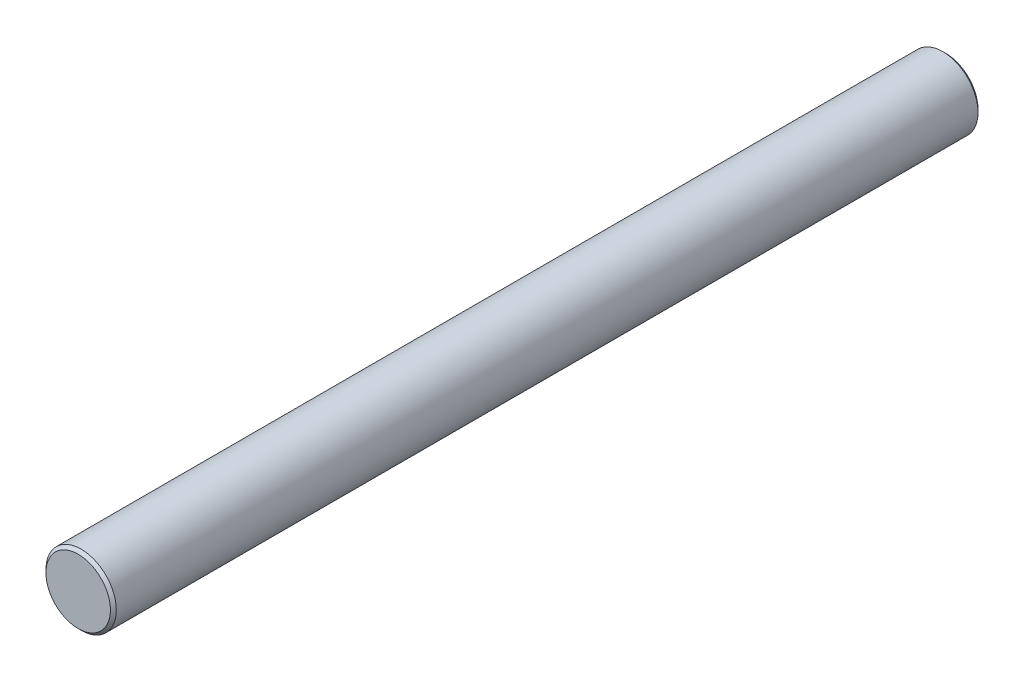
ISO-10303-21;
HEADER;
FILE_DESCRIPTION(('STEP AP214'),'2;1');
FILE_NAME('part.step','',(''),(''),'','','');
FILE_SCHEMA(('AUTOMOTIVE_DESIGN { 1 0 10303 214 1 1 1 1 }'));
ENDSEC;
DATA;
#1=APPLICATION_CONTEXT('core data for automotive mechanical design processes');
#2=APPLICATION_PROTOCOL_DEFINITION('international standard','automotive_design',2000,#1);
#3=PRODUCT_CONTEXT('',#1,'mechanical');
#4=PRODUCT('Part','Part','',(#3));
#5=PRODUCT_RELATED_PRODUCT_CATEGORY('part','',(#4));
#6=PRODUCT_DEFINITION_FORMATION('','',#4);
#7=PRODUCT_DEFINITION_CONTEXT('part definition',#1,'design');
#8=PRODUCT_DEFINITION('design','',#6,#7);
#9=PRODUCT_DEFINITION_SHAPE('','',#8);
#10=(LENGTH_UNIT() NAMED_UNIT(*) SI_UNIT(.MILLI.,.METRE.));
#11=(NAMED_UNIT(*) PLANE_ANGLE_UNIT() SI_UNIT($,.RADIAN.));
#12=(NAMED_UNIT(*) SI_UNIT($,.STERADIAN.) SOLID_ANGLE_UNIT());
#13=UNCERTAINTY_MEASURE_WITH_UNIT(LENGTH_MEASURE(1.E-05),#10,'distance_accuracy_value','');
#14=(GEOMETRIC_REPRESENTATION_CONTEXT(3) GLOBAL_UNCERTAINTY_ASSIGNED_CONTEXT((#13)) GLOBAL_UNIT_ASSIGNED_CONTEXT((#10,
#11,#12)) REPRESENTATION_CONTEXT('',''));
#15=CARTESIAN_POINT('',(0.,0.,0.));
#16=DIRECTION('',(0.,0.,1.));
#17=DIRECTION('',(1.,0.,0.));
#18=AXIS2_PLACEMENT_3D('',#15,#16,#17);
#19=CARTESIAN_POINT('',(0.,0.,74.));
#20=DIRECTION('',(0.,0.,-1.));
#21=DIRECTION('',(-1.,0.,0.));
#22=AXIS2_PLACEMENT_3D('',#19,#20,#21);
#23=CYLINDRICAL_SURFACE('',#22,3.);
#24=CARTESIAN_POINT('',(0.,0.,0.250000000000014));
#25=DIRECTION('',(0.,0.,1.));
#26=DIRECTION('',(1.,0.,0.));
#27=AXIS2_PLACEMENT_3D('',#24,#25,#26);
#28=CIRCLE('',#27,3.);
#29=CARTESIAN_POINT('',(3.,0.,0.250000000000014));
#30=VERTEX_POINT('',#29);
#31=EDGE_CURVE('E40',#30,#30,#28,.T.);
#32=ORIENTED_EDGE('',*,*,#31,.T.);
#33=EDGE_LOOP('',(#32));
#34=FACE_BOUND('',#33,.T.);
#35=CARTESIAN_POINT('',(0.,0.,73.75));
#36=DIRECTION('',(0.,0.,1.));
#37=DIRECTION('',(1.,0.,0.));
#38=AXIS2_PLACEMENT_3D('',#35,#36,#37);
#39=CIRCLE('',#38,3.);
#40=CARTESIAN_POINT('',(3.,0.,73.75));
#41=VERTEX_POINT('',#40);
#42=EDGE_CURVE('E44',#41,#41,#39,.F.);
#43=ORIENTED_EDGE('',*,*,#42,.T.);
#44=EDGE_LOOP('',(#43));
#45=FACE_BOUND('',#44,.T.);
#46=ADVANCED_FACE('F29',(#34,#45),#23,.T.);
#47=CARTESIAN_POINT('',(0.,0.,74.));
#48=DIRECTION('',(0.,0.,1.));
#49=DIRECTION('',(1.,0.,0.));
#50=AXIS2_PLACEMENT_3D('',#47,#48,#49);
#51=PLANE('',#50);
#52=CARTESIAN_POINT('',(0.,0.,74.));
#53=DIRECTION('',(0.,0.,1.));
#54=DIRECTION('',(1.,0.,0.));
#55=AXIS2_PLACEMENT_3D('',#52,#53,#54);
#56=CIRCLE('',#55,2.75000000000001);
#57=CARTESIAN_POINT('',(2.75000000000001,0.,74.));
#58=VERTEX_POINT('',#57);
#59=EDGE_CURVE('E10',#58,#58,#56,.T.);
#60=ORIENTED_EDGE('',*,*,#59,.T.);
#61=EDGE_LOOP('',(#60));
#62=FACE_BOUND('',#61,.T.);
#63=ADVANCED_FACE('F60',(#62),#51,.T.);
#64=CARTESIAN_POINT('',(0.,0.,0.));
#65=DIRECTION('',(0.,0.,1.));
#66=DIRECTION('',(1.,0.,0.));
#67=AXIS2_PLACEMENT_3D('',#64,#65,#66);
#68=PLANE('',#67);
#69=CARTESIAN_POINT('',(0.,0.,0.));
#70=DIRECTION('',(0.,0.,1.));
#71=DIRECTION('',(1.,0.,0.));
#72=AXIS2_PLACEMENT_3D('',#69,#70,#71);
#73=CIRCLE('',#72,2.75);
#74=CARTESIAN_POINT('',(2.75,0.,0.));
#75=VERTEX_POINT('',#74);
#76=EDGE_CURVE('E36',#75,#75,#73,.F.);
#77=ORIENTED_EDGE('',*,*,#76,.T.);
#78=EDGE_LOOP('',(#77));
#79=FACE_BOUND('',#78,.T.);
#80=ADVANCED_FACE('F57',(#79),#68,.F.);
#81=CARTESIAN_POINT('',(0.,0.,0.250000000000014));
#82=DIRECTION('',(0.,0.,1.));
#83=DIRECTION('',(1.,0.,0.));
#84=AXIS2_PLACEMENT_3D('',#81,#82,#83);
#85=CONICAL_SURFACE('',#84,3.,0.785398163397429);
#86=ORIENTED_EDGE('',*,*,#76,.F.);
#87=EDGE_LOOP('',(#86));
#88=FACE_BOUND('',#87,.T.);
#89=ORIENTED_EDGE('',*,*,#31,.F.);
#90=EDGE_LOOP('',(#89));
#91=FACE_BOUND('',#90,.T.);
#92=ADVANCED_FACE('F53',(#88,#91),#85,.T.);
#93=CARTESIAN_POINT('',(0.,0.,74.));
#94=DIRECTION('',(0.,0.,-1.));
#95=DIRECTION('',(-1.,0.,0.));
#96=AXIS2_PLACEMENT_3D('',#93,#94,#95);
#97=CONICAL_SURFACE('',#96,2.75000000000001,0.78539816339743);
#98=ORIENTED_EDGE('',*,*,#42,.F.);
#99=EDGE_LOOP('',(#98));
#100=FACE_BOUND('',#99,.T.);
#101=ORIENTED_EDGE('',*,*,#59,.F.);
#102=EDGE_LOOP('',(#101));
#103=FACE_BOUND('',#102,.T.);
#104=ADVANCED_FACE('F31',(#100,#103),#97,.T.);
#105=CLOSED_SHELL('',(#46,#63,#80,#92,#104));
#106=MANIFOLD_SOLID_BREP('B2',#105);
#107=ADVANCED_BREP_SHAPE_REPRESENTATION('',(#18,#106),#14);
#108=SHAPE_DEFINITION_REPRESENTATION(#9,#107);
ENDSEC;
END-ISO-10303-21;
